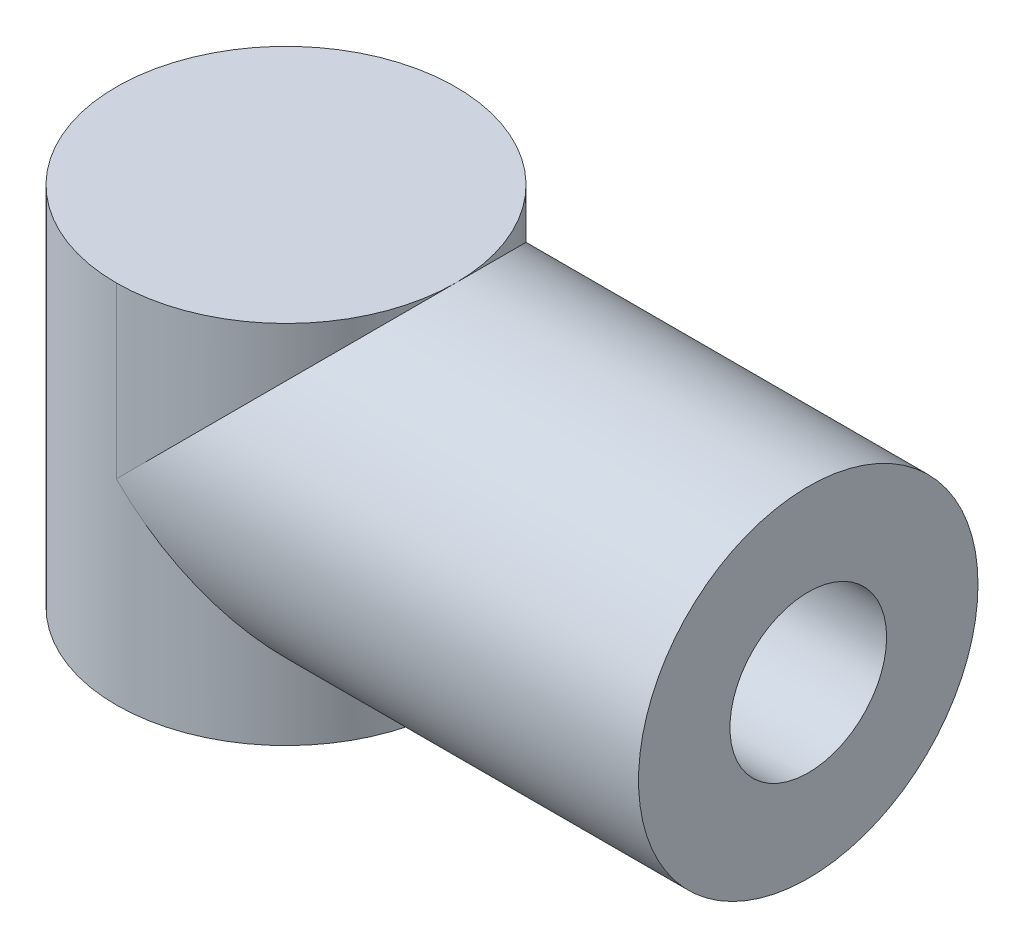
from build123d import *
from build123d.topology import SkipClean

# Parameters (mm, degrees)
ESQUISSE1_W                  = 3.25
ESQUISSE1_H                  = 7
ESQUISSE2_R                  = 3.25
EXTRUSION1_DEPTH             = 10
ESQUISSE4_R                  = 1.5
ENL_V_MAT_EXTRU_2_DEPTH      = 5.5
ENL_V_MAT_EXTRU_1_REACH      = 17.334
ENL_V_MAT_EXTRU_1_END_RADIUS = 1.5
ESQUISSE3_R                  = 1.5


with BuildPart() as part:
    # Esquisse1 → R_volution1 (revolve)
    with BuildSketch(Plane.XY, mode=Mode.PRIVATE) as r_volution1_sk:
        with Locations((1.625, 3.5)):
            Rectangle(ESQUISSE1_W, ESQUISSE1_H)
    revolve(r_volution1_sk.sketch.rotate(Axis((0, 74.884234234, 0), (0, -1, 0)), 90), axis=Axis((0, 74.884234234, 0), (0, -1, 0)))

    # Esquisse2 → Extrusion1 (add)
    with SkipClean():  # the faces are left unmerged after this step: merging them gives an invalid solid
        with BuildSketch(Plane(origin=(0, 0, 0), x_dir=(0, 0, -1), z_dir=(1, 0, 0))):
            with Locations((0, 3.75)):
                Circle(ESQUISSE2_R)
        extrude(amount=EXTRUSION1_DEPTH)

    # Esquisse4 → Enl_v. mat.-Extru.2 (cut)
    with SkipClean():  # the faces are left unmerged after this step: merging them gives an invalid solid
        with BuildSketch(Plane.XZ):
            with Locations(Location((0, 0, 0), (0, 0, 270))):
                Circle(ESQUISSE4_R)
        extrude(amount=-ENL_V_MAT_EXTRU_2_DEPTH, mode=Mode.SUBTRACT)

    # Enl_v. mat.-Extru.1: up to this cylinder (the profile starts outside it)
    with SkipClean():  # the faces are left unmerged after this step: merging them gives an invalid solid
        enl_v_mat_extru_1_end = Plane(origin=(0, 3.75, 0), z_dir=(0, -1, 0)) * Cylinder(ENL_V_MAT_EXTRU_1_END_RADIUS, 38.668, mode=Mode.PRIVATE)
        # Esquisse3 → Enl_v. mat.-Extru.1 (cut, up to the surface)
        with BuildSketch(Plane(origin=(10, 0, 0), x_dir=(0, 0, -1), z_dir=(1, 0, 0)), mode=Mode.PRIVATE) as enl_v_mat_extru_1_sk1:
            with Locations((0, 3.75)):
                Circle(ESQUISSE3_R)
        enl_v_mat_extru_1_tool1 = extrude(enl_v_mat_extru_1_sk1.sketch, amount=-ENL_V_MAT_EXTRU_1_REACH, mode=Mode.PRIVATE) - enl_v_mat_extru_1_end
        add(enl_v_mat_extru_1_tool1.solids().sort_by_distance((10, 3.75, 0))[0], mode=Mode.SUBTRACT)


solid = part.part
